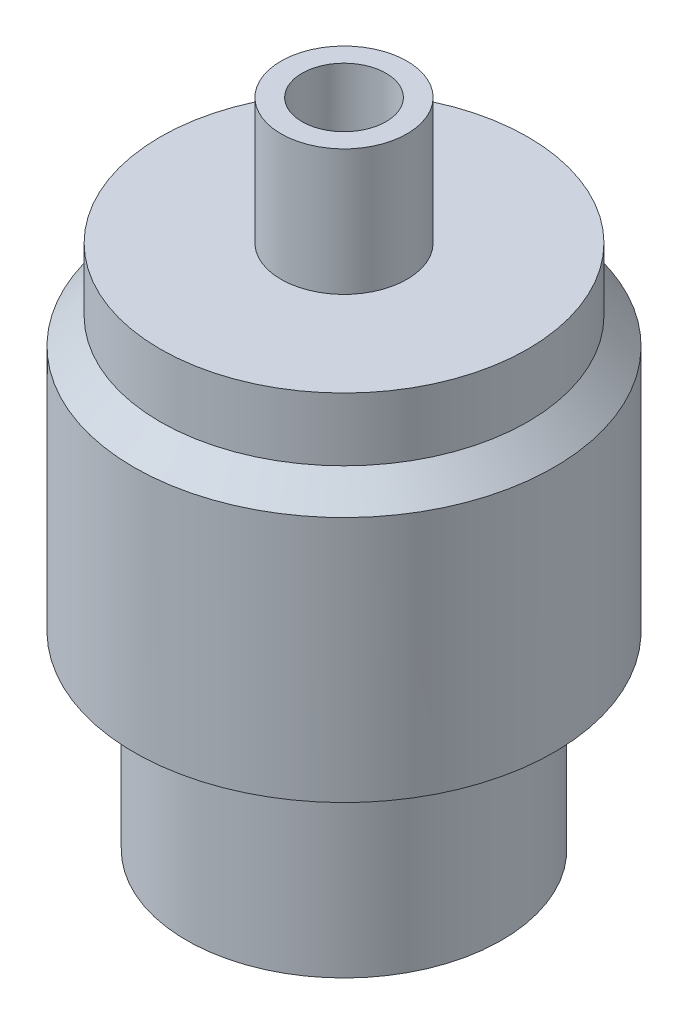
ISO-10303-21;
HEADER;
FILE_DESCRIPTION(('STEP AP214'),'2;1');
FILE_NAME('part.step','',(''),(''),'','','');
FILE_SCHEMA(('AUTOMOTIVE_DESIGN { 1 0 10303 214 1 1 1 1 }'));
ENDSEC;
DATA;
#1=APPLICATION_CONTEXT('core data for automotive mechanical design processes');
#2=APPLICATION_PROTOCOL_DEFINITION('international standard','automotive_design',2000,#1);
#3=PRODUCT_CONTEXT('',#1,'mechanical');
#4=PRODUCT('Part','Part','',(#3));
#5=PRODUCT_RELATED_PRODUCT_CATEGORY('part','',(#4));
#6=PRODUCT_DEFINITION_FORMATION('','',#4);
#7=PRODUCT_DEFINITION_CONTEXT('part definition',#1,'design');
#8=PRODUCT_DEFINITION('design','',#6,#7);
#9=PRODUCT_DEFINITION_SHAPE('','',#8);
#10=(LENGTH_UNIT() NAMED_UNIT(*) SI_UNIT(.MILLI.,.METRE.));
#11=(NAMED_UNIT(*) PLANE_ANGLE_UNIT() SI_UNIT($,.RADIAN.));
#12=(NAMED_UNIT(*) SI_UNIT($,.STERADIAN.) SOLID_ANGLE_UNIT());
#13=UNCERTAINTY_MEASURE_WITH_UNIT(LENGTH_MEASURE(1.E-05),#10,'distance_accuracy_value','');
#14=(GEOMETRIC_REPRESENTATION_CONTEXT(3) GLOBAL_UNCERTAINTY_ASSIGNED_CONTEXT((#13)) GLOBAL_UNIT_ASSIGNED_CONTEXT((#10,
#11,#12)) REPRESENTATION_CONTEXT('',''));
#15=CARTESIAN_POINT('',(0.,0.,0.));
#16=DIRECTION('',(0.,0.,1.));
#17=DIRECTION('',(1.,0.,0.));
#18=AXIS2_PLACEMENT_3D('',#15,#16,#17);
#19=CARTESIAN_POINT('',(0.,25.,0.));
#20=DIRECTION('',(0.,-1.,0.));
#21=DIRECTION('',(0.,0.,-1.));
#22=AXIS2_PLACEMENT_3D('',#19,#20,#21);
#23=CYLINDRICAL_SURFACE('',#22,10.);
#24=CARTESIAN_POINT('',(0.,20.75,0.));
#25=DIRECTION('',(0.,1.,0.));
#26=DIRECTION('',(0.,0.,1.));
#27=AXIS2_PLACEMENT_3D('',#24,#25,#26);
#28=CIRCLE('',#27,10.);
#29=CARTESIAN_POINT('',(0.,20.75,10.));
#30=VERTEX_POINT('',#29);
#31=EDGE_CURVE('E11',#30,#30,#28,.F.);
#32=ORIENTED_EDGE('',*,*,#31,.T.);
#33=EDGE_LOOP('',(#32));
#34=FACE_BOUND('',#33,.T.);
#35=CARTESIAN_POINT('',(0.,9.00000000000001,0.));
#36=DIRECTION('',(0.,-1.,0.));
#37=DIRECTION('',(0.,0.,-1.));
#38=AXIS2_PLACEMENT_3D('',#35,#36,#37);
#39=CIRCLE('',#38,10.);
#40=CARTESIAN_POINT('',(0.,9.00000000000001,-10.));
#41=VERTEX_POINT('',#40);
#42=EDGE_CURVE('E43',#41,#41,#39,.F.);
#43=ORIENTED_EDGE('',*,*,#42,.T.);
#44=EDGE_LOOP('',(#43));
#45=FACE_BOUND('',#44,.T.);
#46=ADVANCED_FACE('F35',(#34,#45),#23,.T.);
#47=CARTESIAN_POINT('',(0.,25.,0.));
#48=DIRECTION('',(0.,1.,0.));
#49=DIRECTION('',(0.,0.,1.));
#50=AXIS2_PLACEMENT_3D('',#47,#48,#49);
#51=PLANE('',#50);
#52=CARTESIAN_POINT('',(0.,25.,0.));
#53=DIRECTION('',(0.,1.,0.));
#54=DIRECTION('',(0.,0.,1.));
#55=AXIS2_PLACEMENT_3D('',#52,#53,#54);
#56=CIRCLE('',#55,8.75);
#57=CARTESIAN_POINT('',(0.,25.,8.75));
#58=VERTEX_POINT('',#57);
#59=EDGE_CURVE('E50',#58,#58,#56,.T.);
#60=ORIENTED_EDGE('',*,*,#59,.T.);
#61=EDGE_LOOP('',(#60));
#62=FACE_BOUND('',#61,.T.);
#63=CARTESIAN_POINT('',(0.,25.,0.));
#64=DIRECTION('',(0.,1.,0.));
#65=DIRECTION('',(0.,0.,1.));
#66=AXIS2_PLACEMENT_3D('',#63,#64,#65);
#67=CIRCLE('',#66,3.);
#68=CARTESIAN_POINT('',(0.,25.,3.));
#69=VERTEX_POINT('',#68);
#70=EDGE_CURVE('E56',#69,#69,#67,.T.);
#71=ORIENTED_EDGE('',*,*,#70,.F.);
#72=EDGE_LOOP('',(#71));
#73=FACE_BOUND('',#72,.T.);
#74=ADVANCED_FACE('F93',(#62,#73),#51,.T.);
#75=CARTESIAN_POINT('',(0.,22.,0.));
#76=DIRECTION('',(0.,1.,0.));
#77=DIRECTION('',(0.,0.,1.));
#78=AXIS2_PLACEMENT_3D('',#75,#76,#77);
#79=CYLINDRICAL_SURFACE('',#78,8.75);
#80=CARTESIAN_POINT('',(0.,22.,0.));
#81=DIRECTION('',(0.,1.,0.));
#82=DIRECTION('',(0.,0.,1.));
#83=AXIS2_PLACEMENT_3D('',#80,#81,#82);
#84=CIRCLE('',#83,8.75);
#85=CARTESIAN_POINT('',(0.,22.,8.75));
#86=VERTEX_POINT('',#85);
#87=EDGE_CURVE('E47',#86,#86,#84,.T.);
#88=ORIENTED_EDGE('',*,*,#87,.T.);
#89=EDGE_LOOP('',(#88));
#90=FACE_BOUND('',#89,.T.);
#91=ORIENTED_EDGE('',*,*,#59,.F.);
#92=EDGE_LOOP('',(#91));
#93=FACE_BOUND('',#92,.T.);
#94=ADVANCED_FACE('F98',(#90,#93),#79,.T.);
#95=CARTESIAN_POINT('',(0.,31.,0.));
#96=DIRECTION('',(0.,-1.,0.));
#97=DIRECTION('',(0.,0.,-1.));
#98=AXIS2_PLACEMENT_3D('',#95,#96,#97);
#99=CYLINDRICAL_SURFACE('',#98,3.);
#100=CARTESIAN_POINT('',(0.,31.,0.));
#101=DIRECTION('',(0.,1.,0.));
#102=DIRECTION('',(0.,0.,1.));
#103=AXIS2_PLACEMENT_3D('',#100,#101,#102);
#104=CIRCLE('',#103,3.);
#105=CARTESIAN_POINT('',(0.,31.,3.));
#106=VERTEX_POINT('',#105);
#107=EDGE_CURVE('E53',#106,#106,#104,.T.);
#108=ORIENTED_EDGE('',*,*,#107,.F.);
#109=EDGE_LOOP('',(#108));
#110=FACE_BOUND('',#109,.T.);
#111=ORIENTED_EDGE('',*,*,#70,.T.);
#112=EDGE_LOOP('',(#111));
#113=FACE_BOUND('',#112,.T.);
#114=ADVANCED_FACE('F127',(#110,#113),#99,.T.);
#115=CARTESIAN_POINT('',(0.,31.,0.));
#116=DIRECTION('',(0.,1.,0.));
#117=DIRECTION('',(0.,0.,1.));
#118=AXIS2_PLACEMENT_3D('',#115,#116,#117);
#119=PLANE('',#118);
#120=CARTESIAN_POINT('',(0.,31.,0.));
#121=DIRECTION('',(0.,1.,0.));
#122=DIRECTION('',(0.,0.,1.));
#123=AXIS2_PLACEMENT_3D('',#120,#121,#122);
#124=CIRCLE('',#123,2.);
#125=CARTESIAN_POINT('',(0.,31.,2.));
#126=VERTEX_POINT('',#125);
#127=EDGE_CURVE('E73',#126,#126,#124,.T.);
#128=ORIENTED_EDGE('',*,*,#127,.F.);
#129=EDGE_LOOP('',(#128));
#130=FACE_BOUND('',#129,.T.);
#131=ORIENTED_EDGE('',*,*,#107,.T.);
#132=EDGE_LOOP('',(#131));
#133=FACE_BOUND('',#132,.T.);
#134=ADVANCED_FACE('F120',(#130,#133),#119,.T.);
#135=CARTESIAN_POINT('',(0.,7.5,0.));
#136=DIRECTION('',(0.,-1.,0.));
#137=DIRECTION('',(0.,0.,-1.));
#138=AXIS2_PLACEMENT_3D('',#135,#136,#137);
#139=CYLINDRICAL_SURFACE('',#138,7.5);
#140=CARTESIAN_POINT('',(0.,7.5,0.));
#141=DIRECTION('',(0.,-1.,0.));
#142=DIRECTION('',(0.,0.,-1.));
#143=AXIS2_PLACEMENT_3D('',#140,#141,#142);
#144=CIRCLE('',#143,7.5);
#145=CARTESIAN_POINT('',(0.,7.5,-7.5));
#146=VERTEX_POINT('',#145);
#147=EDGE_CURVE('E59',#146,#146,#144,.T.);
#148=ORIENTED_EDGE('',*,*,#147,.T.);
#149=EDGE_LOOP('',(#148));
#150=FACE_BOUND('',#149,.T.);
#151=CARTESIAN_POINT('',(0.,0.,0.));
#152=DIRECTION('',(0.,-1.,0.));
#153=DIRECTION('',(0.,0.,-1.));
#154=AXIS2_PLACEMENT_3D('',#151,#152,#153);
#155=CIRCLE('',#154,7.5);
#156=CARTESIAN_POINT('',(0.,0.,-7.5));
#157=VERTEX_POINT('',#156);
#158=EDGE_CURVE('E62',#157,#157,#155,.T.);
#159=ORIENTED_EDGE('',*,*,#158,.F.);
#160=EDGE_LOOP('',(#159));
#161=FACE_BOUND('',#160,.T.);
#162=ADVANCED_FACE('F112',(#150,#161),#139,.T.);
#163=CARTESIAN_POINT('',(0.,0.,0.));
#164=DIRECTION('',(0.,1.,0.));
#165=DIRECTION('',(0.,0.,1.));
#166=AXIS2_PLACEMENT_3D('',#163,#164,#165);
#167=PLANE('',#166);
#168=CARTESIAN_POINT('',(0.,0.,0.));
#169=DIRECTION('',(0.,-1.,0.));
#170=DIRECTION('',(0.,0.,-1.));
#171=AXIS2_PLACEMENT_3D('',#168,#169,#170);
#172=CIRCLE('',#171,3.5);
#173=CARTESIAN_POINT('',(0.,0.,-3.5));
#174=VERTEX_POINT('',#173);
#175=EDGE_CURVE('E70',#174,#174,#172,.T.);
#176=ORIENTED_EDGE('',*,*,#175,.F.);
#177=EDGE_LOOP('',(#176));
#178=FACE_BOUND('',#177,.T.);
#179=ORIENTED_EDGE('',*,*,#158,.T.);
#180=EDGE_LOOP('',(#179));
#181=FACE_BOUND('',#180,.T.);
#182=ADVANCED_FACE('F103',(#178,#181),#167,.F.);
#183=CARTESIAN_POINT('',(0.,7.5,0.));
#184=DIRECTION('',(0.,1.,0.));
#185=DIRECTION('',(0.,0.,1.));
#186=AXIS2_PLACEMENT_3D('',#183,#184,#185);
#187=CONICAL_SURFACE('',#186,7.49999999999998,1.03037682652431);
#188=ORIENTED_EDGE('',*,*,#42,.F.);
#189=EDGE_LOOP('',(#188));
#190=FACE_BOUND('',#189,.T.);
#191=ORIENTED_EDGE('',*,*,#147,.F.);
#192=EDGE_LOOP('',(#191));
#193=FACE_BOUND('',#192,.T.);
#194=ADVANCED_FACE('F104',(#190,#193),#187,.T.);
#195=CARTESIAN_POINT('',(0.,22.,0.));
#196=DIRECTION('',(0.,-1.,0.));
#197=DIRECTION('',(0.,0.,-1.));
#198=AXIS2_PLACEMENT_3D('',#195,#196,#197);
#199=CONICAL_SURFACE('',#198,8.75,0.785398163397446);
#200=ORIENTED_EDGE('',*,*,#31,.F.);
#201=EDGE_LOOP('',(#200));
#202=FACE_BOUND('',#201,.T.);
#203=ORIENTED_EDGE('',*,*,#87,.F.);
#204=EDGE_LOOP('',(#203));
#205=FACE_BOUND('',#204,.T.);
#206=ADVANCED_FACE('F37',(#202,#205),#199,.T.);
#207=CARTESIAN_POINT('',(0.,20.,0.));
#208=DIRECTION('',(0.,-1.,0.));
#209=DIRECTION('',(0.,0.,-1.));
#210=AXIS2_PLACEMENT_3D('',#207,#208,#209);
#211=CONICAL_SURFACE('',#210,3.5,1.0471975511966);
#212=CARTESIAN_POINT('',(0.,20.8660254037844,0.));
#213=DIRECTION('',(0.,-1.,0.));
#214=DIRECTION('',(0.,0.,-1.));
#215=AXIS2_PLACEMENT_3D('',#212,#213,#214);
#216=CIRCLE('',#215,2.);
#217=CARTESIAN_POINT('',(0.,20.8660254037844,-2.));
#218=VERTEX_POINT('',#217);
#219=EDGE_CURVE('E39',#218,#218,#216,.F.);
#220=ORIENTED_EDGE('',*,*,#219,.T.);
#221=EDGE_LOOP('',(#220));
#222=FACE_BOUND('',#221,.T.);
#223=CARTESIAN_POINT('',(0.,20.,0.));
#224=DIRECTION('',(0.,-1.,0.));
#225=DIRECTION('',(0.,0.,-1.));
#226=AXIS2_PLACEMENT_3D('',#223,#224,#225);
#227=CIRCLE('',#226,3.5);
#228=CARTESIAN_POINT('',(0.,20.,-3.5));
#229=VERTEX_POINT('',#228);
#230=EDGE_CURVE('E65',#229,#229,#227,.T.);
#231=ORIENTED_EDGE('',*,*,#230,.T.);
#232=EDGE_LOOP('',(#231));
#233=FACE_BOUND('',#232,.T.);
#234=ADVANCED_FACE('F80',(#222,#233),#211,.F.);
#235=CARTESIAN_POINT('',(0.,0.,0.));
#236=DIRECTION('',(0.,-1.,0.));
#237=DIRECTION('',(0.,0.,-1.));
#238=AXIS2_PLACEMENT_3D('',#235,#236,#237);
#239=CYLINDRICAL_SURFACE('',#238,3.5);
#240=ORIENTED_EDGE('',*,*,#230,.F.);
#241=EDGE_LOOP('',(#240));
#242=FACE_BOUND('',#241,.T.);
#243=ORIENTED_EDGE('',*,*,#175,.T.);
#244=EDGE_LOOP('',(#243));
#245=FACE_BOUND('',#244,.T.);
#246=ADVANCED_FACE('F85',(#242,#245),#239,.F.);
#247=CARTESIAN_POINT('',(0.,0.,0.));
#248=DIRECTION('',(0.,1.,0.));
#249=DIRECTION('',(0.,0.,1.));
#250=AXIS2_PLACEMENT_3D('',#247,#248,#249);
#251=CYLINDRICAL_SURFACE('',#250,2.);
#252=ORIENTED_EDGE('',*,*,#127,.T.);
#253=EDGE_LOOP('',(#252));
#254=FACE_BOUND('',#253,.T.);
#255=ORIENTED_EDGE('',*,*,#219,.F.);
#256=EDGE_LOOP('',(#255));
#257=FACE_BOUND('',#256,.T.);
#258=ADVANCED_FACE('F83',(#254,#257),#251,.F.);
#259=CLOSED_SHELL('',(#46,#74,#94,#114,#134,#162,#182,#194,#206,#234,#246,#258));
#260=MANIFOLD_SOLID_BREP('B2',#259);
#261=ADVANCED_BREP_SHAPE_REPRESENTATION('',(#18,#260),#14);
#262=SHAPE_DEFINITION_REPRESENTATION(#9,#261);
ENDSEC;
END-ISO-10303-21;
